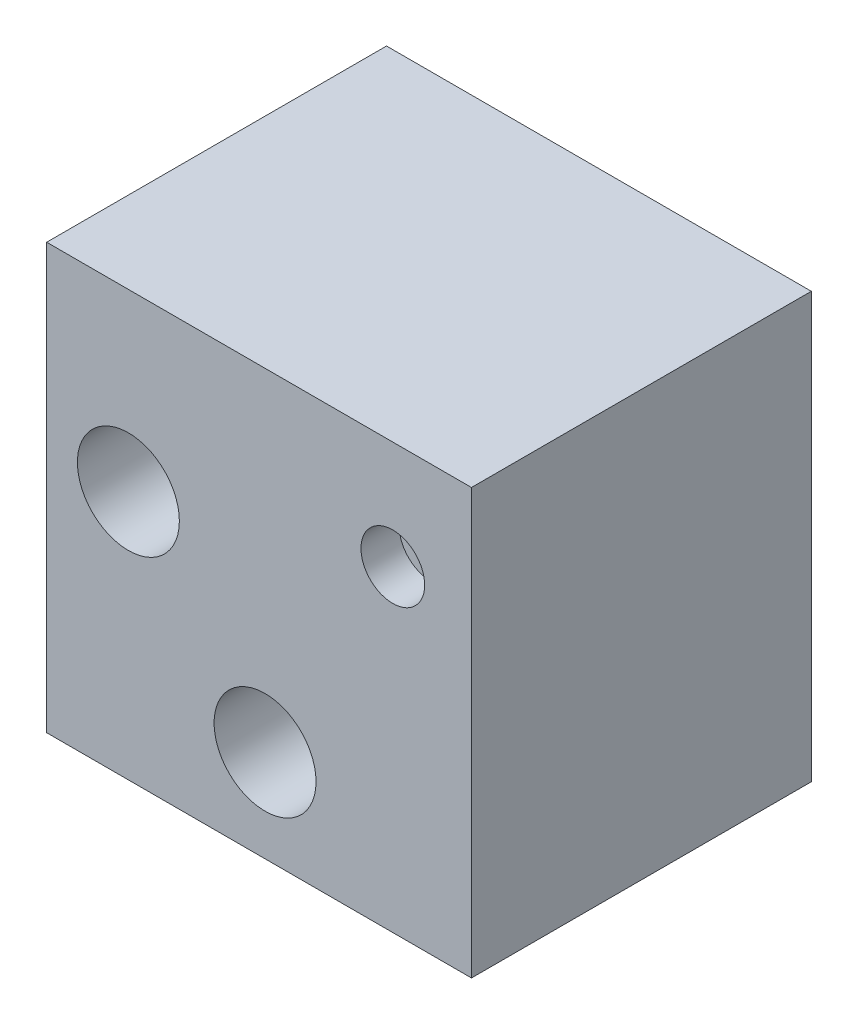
ISO-10303-21;
HEADER;
FILE_DESCRIPTION(('STEP AP214'),'2;1');
FILE_NAME('part.step','',(''),(''),'','','');
FILE_SCHEMA(('AUTOMOTIVE_DESIGN { 1 0 10303 214 1 1 1 1 }'));
ENDSEC;
DATA;
#1=APPLICATION_CONTEXT('core data for automotive mechanical design processes');
#2=APPLICATION_PROTOCOL_DEFINITION('international standard','automotive_design',2000,#1);
#3=PRODUCT_CONTEXT('',#1,'mechanical');
#4=PRODUCT('Part','Part','',(#3));
#5=PRODUCT_RELATED_PRODUCT_CATEGORY('part','',(#4));
#6=PRODUCT_DEFINITION_FORMATION('','',#4);
#7=PRODUCT_DEFINITION_CONTEXT('part definition',#1,'design');
#8=PRODUCT_DEFINITION('design','',#6,#7);
#9=PRODUCT_DEFINITION_SHAPE('','',#8);
#10=(LENGTH_UNIT() NAMED_UNIT(*) SI_UNIT(.MILLI.,.METRE.));
#11=(NAMED_UNIT(*) PLANE_ANGLE_UNIT() SI_UNIT($,.RADIAN.));
#12=(NAMED_UNIT(*) SI_UNIT($,.STERADIAN.) SOLID_ANGLE_UNIT());
#13=UNCERTAINTY_MEASURE_WITH_UNIT(LENGTH_MEASURE(1.E-05),#10,'distance_accuracy_value','');
#14=(GEOMETRIC_REPRESENTATION_CONTEXT(3) GLOBAL_UNCERTAINTY_ASSIGNED_CONTEXT((#13)) GLOBAL_UNIT_ASSIGNED_CONTEXT((#10,
#11,#12)) REPRESENTATION_CONTEXT('',''));
#15=CARTESIAN_POINT('',(0.,0.,0.));
#16=DIRECTION('',(0.,0.,1.));
#17=DIRECTION('',(1.,0.,0.));
#18=AXIS2_PLACEMENT_3D('',#15,#16,#17);
#19=CARTESIAN_POINT('',(0.,0.,80.));
#20=DIRECTION('',(1.,0.,0.));
#21=DIRECTION('',(0.,0.,-1.));
#22=AXIS2_PLACEMENT_3D('',#19,#20,#21);
#23=PLANE('',#22);
#24=DIRECTION('',(0.,-1.,0.));
#25=VECTOR('',#24,1.);
#26=CARTESIAN_POINT('',(0.,0.,0.));
#27=LINE('',#26,#25);
#28=CARTESIAN_POINT('',(0.,100.,0.));
#29=VERTEX_POINT('',#28);
#30=CARTESIAN_POINT('',(0.,0.,0.));
#31=VERTEX_POINT('',#30);
#32=EDGE_CURVE('E130',#29,#31,#27,.T.);
#33=ORIENTED_EDGE('',*,*,#32,.T.);
#34=DIRECTION('',(0.,0.,-1.));
#35=VECTOR('',#34,1.);
#36=CARTESIAN_POINT('',(0.,0.,80.));
#37=LINE('',#36,#35);
#38=CARTESIAN_POINT('',(0.,0.,80.));
#39=VERTEX_POINT('',#38);
#40=EDGE_CURVE('E11',#39,#31,#37,.T.);
#41=ORIENTED_EDGE('',*,*,#40,.F.);
#42=DIRECTION('',(0.,-1.,0.));
#43=VECTOR('',#42,1.);
#44=CARTESIAN_POINT('',(0.,0.,80.));
#45=LINE('',#44,#43);
#46=CARTESIAN_POINT('',(0.,100.,80.));
#47=VERTEX_POINT('',#46);
#48=EDGE_CURVE('E131',#47,#39,#45,.T.);
#49=ORIENTED_EDGE('',*,*,#48,.F.);
#50=DIRECTION('',(0.,0.,-1.));
#51=VECTOR('',#50,1.);
#52=CARTESIAN_POINT('',(0.,100.,80.));
#53=LINE('',#52,#51);
#54=EDGE_CURVE('E137',#47,#29,#53,.T.);
#55=ORIENTED_EDGE('',*,*,#54,.T.);
#56=EDGE_LOOP('',(#33,#41,#49,#55));
#57=FACE_BOUND('',#56,.T.);
#58=ADVANCED_FACE('F41',(#57),#23,.F.);
#59=CARTESIAN_POINT('',(0.,0.,80.));
#60=DIRECTION('',(0.,1.,0.));
#61=DIRECTION('',(0.,0.,1.));
#62=AXIS2_PLACEMENT_3D('',#59,#60,#61);
#63=PLANE('',#62);
#64=DIRECTION('',(1.,0.,0.));
#65=VECTOR('',#64,1.);
#66=CARTESIAN_POINT('',(0.,0.,0.));
#67=LINE('',#66,#65);
#68=CARTESIAN_POINT('',(100.,0.,0.));
#69=VERTEX_POINT('',#68);
#70=EDGE_CURVE('E140',#31,#69,#67,.T.);
#71=ORIENTED_EDGE('',*,*,#70,.T.);
#72=DIRECTION('',(0.,0.,-1.));
#73=VECTOR('',#72,1.);
#74=CARTESIAN_POINT('',(100.,0.,80.));
#75=LINE('',#74,#73);
#76=CARTESIAN_POINT('',(100.,0.,80.));
#77=VERTEX_POINT('',#76);
#78=EDGE_CURVE('E49',#77,#69,#75,.T.);
#79=ORIENTED_EDGE('',*,*,#78,.F.);
#80=DIRECTION('',(1.,0.,0.));
#81=VECTOR('',#80,1.);
#82=CARTESIAN_POINT('',(0.,0.,80.));
#83=LINE('',#82,#81);
#84=EDGE_CURVE('E88',#39,#77,#83,.T.);
#85=ORIENTED_EDGE('',*,*,#84,.F.);
#86=ORIENTED_EDGE('',*,*,#40,.T.);
#87=EDGE_LOOP('',(#71,#79,#85,#86));
#88=FACE_BOUND('',#87,.T.);
#89=ADVANCED_FACE('F164',(#88),#63,.F.);
#90=CARTESIAN_POINT('',(100.,0.,80.));
#91=DIRECTION('',(-1.,0.,0.));
#92=DIRECTION('',(0.,0.,1.));
#93=AXIS2_PLACEMENT_3D('',#90,#91,#92);
#94=PLANE('',#93);
#95=DIRECTION('',(0.,1.,0.));
#96=VECTOR('',#95,1.);
#97=CARTESIAN_POINT('',(100.,0.,0.));
#98=LINE('',#97,#96);
#99=CARTESIAN_POINT('',(100.,100.,0.));
#100=VERTEX_POINT('',#99);
#101=EDGE_CURVE('E75',#69,#100,#98,.T.);
#102=ORIENTED_EDGE('',*,*,#101,.T.);
#103=DIRECTION('',(0.,0.,-1.));
#104=VECTOR('',#103,1.);
#105=CARTESIAN_POINT('',(100.,100.,80.));
#106=LINE('',#105,#104);
#107=CARTESIAN_POINT('',(100.,100.,80.));
#108=VERTEX_POINT('',#107);
#109=EDGE_CURVE('E145',#108,#100,#106,.T.);
#110=ORIENTED_EDGE('',*,*,#109,.F.);
#111=DIRECTION('',(0.,1.,0.));
#112=VECTOR('',#111,1.);
#113=CARTESIAN_POINT('',(100.,0.,80.));
#114=LINE('',#113,#112);
#115=EDGE_CURVE('E134',#77,#108,#114,.T.);
#116=ORIENTED_EDGE('',*,*,#115,.F.);
#117=ORIENTED_EDGE('',*,*,#78,.T.);
#118=EDGE_LOOP('',(#102,#110,#116,#117));
#119=FACE_BOUND('',#118,.T.);
#120=ADVANCED_FACE('F147',(#119),#94,.F.);
#121=CARTESIAN_POINT('',(0.,100.,80.));
#122=DIRECTION('',(0.,-1.,0.));
#123=DIRECTION('',(0.,0.,-1.));
#124=AXIS2_PLACEMENT_3D('',#121,#122,#123);
#125=PLANE('',#124);
#126=DIRECTION('',(-1.,0.,0.));
#127=VECTOR('',#126,1.);
#128=CARTESIAN_POINT('',(0.,100.,0.));
#129=LINE('',#128,#127);
#130=EDGE_CURVE('E81',#100,#29,#129,.T.);
#131=ORIENTED_EDGE('',*,*,#130,.T.);
#132=ORIENTED_EDGE('',*,*,#54,.F.);
#133=DIRECTION('',(-1.,0.,0.));
#134=VECTOR('',#133,1.);
#135=CARTESIAN_POINT('',(0.,100.,80.));
#136=LINE('',#135,#134);
#137=EDGE_CURVE('E57',#108,#47,#136,.T.);
#138=ORIENTED_EDGE('',*,*,#137,.F.);
#139=ORIENTED_EDGE('',*,*,#109,.T.);
#140=EDGE_LOOP('',(#131,#132,#138,#139));
#141=FACE_BOUND('',#140,.T.);
#142=ADVANCED_FACE('F154',(#141),#125,.F.);
#143=CARTESIAN_POINT('',(0.,100.,80.));
#144=DIRECTION('',(0.,0.,-1.));
#145=DIRECTION('',(-1.,0.,0.));
#146=AXIS2_PLACEMENT_3D('',#143,#144,#145);
#147=PLANE('',#146);
#148=CARTESIAN_POINT('',(81.479946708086,74.5868835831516,80.));
#149=DIRECTION('',(0.,0.,1.));
#150=DIRECTION('',(1.,0.,0.));
#151=AXIS2_PLACEMENT_3D('',#148,#149,#150);
#152=CIRCLE('',#151,7.50000000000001);
#153=CARTESIAN_POINT('',(88.979946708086,74.5868835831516,80.));
#154=VERTEX_POINT('',#153);
#155=EDGE_CURVE('E352',#154,#154,#152,.T.);
#156=ORIENTED_EDGE('',*,*,#155,.F.);
#157=EDGE_LOOP('',(#156));
#158=FACE_BOUND('',#157,.T.);
#159=CARTESIAN_POINT('',(19.2360886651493,58.7670579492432,80.));
#160=DIRECTION('',(0.,0.,1.));
#161=DIRECTION('',(1.,0.,0.));
#162=AXIS2_PLACEMENT_3D('',#159,#160,#161);
#163=CIRCLE('',#162,12.);
#164=CARTESIAN_POINT('',(31.2360886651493,58.7670579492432,80.));
#165=VERTEX_POINT('',#164);
#166=EDGE_CURVE('E362',#165,#165,#163,.T.);
#167=ORIENTED_EDGE('',*,*,#166,.F.);
#168=EDGE_LOOP('',(#167));
#169=FACE_BOUND('',#168,.T.);
#170=CARTESIAN_POINT('',(51.4111414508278,21.704928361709,80.));
#171=DIRECTION('',(0.,0.,1.));
#172=DIRECTION('',(1.,0.,0.));
#173=AXIS2_PLACEMENT_3D('',#170,#171,#172);
#174=CIRCLE('',#173,12.);
#175=CARTESIAN_POINT('',(63.4111414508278,21.704928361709,80.));
#176=VERTEX_POINT('',#175);
#177=EDGE_CURVE('E105',#176,#176,#174,.T.);
#178=ORIENTED_EDGE('',*,*,#177,.F.);
#179=EDGE_LOOP('',(#178));
#180=FACE_BOUND('',#179,.T.);
#181=ORIENTED_EDGE('',*,*,#48,.T.);
#182=ORIENTED_EDGE('',*,*,#84,.T.);
#183=ORIENTED_EDGE('',*,*,#115,.T.);
#184=ORIENTED_EDGE('',*,*,#137,.T.);
#185=EDGE_LOOP('',(#181,#182,#183,#184));
#186=FACE_BOUND('',#185,.T.);
#187=ADVANCED_FACE('F156',(#158,#169,#180,#186),#147,.F.);
#188=CARTESIAN_POINT('',(0.,100.,0.));
#189=DIRECTION('',(0.,0.,-1.));
#190=DIRECTION('',(-1.,0.,0.));
#191=AXIS2_PLACEMENT_3D('',#188,#189,#190);
#192=PLANE('',#191);
#193=CARTESIAN_POINT('',(81.479946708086,74.5868835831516,0.));
#194=DIRECTION('',(0.,0.,1.));
#195=DIRECTION('',(1.,0.,0.));
#196=AXIS2_PLACEMENT_3D('',#193,#194,#195);
#197=CIRCLE('',#196,4.20000000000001);
#198=CARTESIAN_POINT('',(85.679946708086,74.5868835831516,0.));
#199=VERTEX_POINT('',#198);
#200=EDGE_CURVE('E359',#199,#199,#197,.T.);
#201=ORIENTED_EDGE('',*,*,#200,.T.);
#202=EDGE_LOOP('',(#201));
#203=FACE_BOUND('',#202,.T.);
#204=ORIENTED_EDGE('',*,*,#32,.F.);
#205=ORIENTED_EDGE('',*,*,#130,.F.);
#206=ORIENTED_EDGE('',*,*,#101,.F.);
#207=ORIENTED_EDGE('',*,*,#70,.F.);
#208=EDGE_LOOP('',(#204,#205,#206,#207));
#209=FACE_BOUND('',#208,.T.);
#210=ADVANCED_FACE('F150',(#203,#209),#192,.T.);
#211=CARTESIAN_POINT('',(51.4111414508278,21.704928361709,20.));
#212=DIRECTION('',(0.,0.,1.));
#213=DIRECTION('',(1.,0.,0.));
#214=AXIS2_PLACEMENT_3D('',#211,#212,#213);
#215=CONICAL_SURFACE('',#214,5.,1.02974425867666);
#216=CARTESIAN_POINT('',(51.4111414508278,21.704928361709,16.9956969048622));
#217=VERTEX_POINT('',#216);
#218=VERTEX_LOOP('',#217);
#219=FACE_BOUND('',#218,.T.);
#220=CARTESIAN_POINT('',(51.4111414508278,21.704928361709,20.));
#221=DIRECTION('',(0.,0.,1.));
#222=DIRECTION('',(1.,0.,0.));
#223=AXIS2_PLACEMENT_3D('',#220,#221,#222);
#224=CIRCLE('',#223,5.);
#225=CARTESIAN_POINT('',(56.4111414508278,21.704928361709,20.));
#226=VERTEX_POINT('',#225);
#227=EDGE_CURVE('E127',#226,#226,#224,.T.);
#228=ORIENTED_EDGE('',*,*,#227,.T.);
#229=EDGE_LOOP('',(#228));
#230=FACE_BOUND('',#229,.T.);
#231=ADVANCED_FACE('F187',(#219,#230),#215,.F.);
#232=CARTESIAN_POINT('',(51.4111414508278,21.704928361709,80.));
#233=DIRECTION('',(0.,0.,1.));
#234=DIRECTION('',(1.,0.,0.));
#235=AXIS2_PLACEMENT_3D('',#232,#233,#234);
#236=CYLINDRICAL_SURFACE('',#235,5.);
#237=ORIENTED_EDGE('',*,*,#227,.F.);
#238=EDGE_LOOP('',(#237));
#239=FACE_BOUND('',#238,.T.);
#240=CARTESIAN_POINT('',(51.4111414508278,21.704928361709,45.));
#241=DIRECTION('',(0.,0.,1.));
#242=DIRECTION('',(1.,0.,0.));
#243=AXIS2_PLACEMENT_3D('',#240,#241,#242);
#244=CIRCLE('',#243,5.);
#245=CARTESIAN_POINT('',(56.4111414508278,21.704928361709,45.));
#246=VERTEX_POINT('',#245);
#247=EDGE_CURVE('E124',#246,#246,#244,.T.);
#248=ORIENTED_EDGE('',*,*,#247,.T.);
#249=EDGE_LOOP('',(#248));
#250=FACE_BOUND('',#249,.T.);
#251=ADVANCED_FACE('F192',(#239,#250),#236,.F.);
#252=CARTESIAN_POINT('',(57.6111414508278,21.704928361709,45.));
#253=DIRECTION('',(0.,0.,-1.));
#254=DIRECTION('',(-1.,0.,0.));
#255=AXIS2_PLACEMENT_3D('',#252,#253,#254);
#256=PLANE('',#255);
#257=ORIENTED_EDGE('',*,*,#247,.F.);
#258=EDGE_LOOP('',(#257));
#259=FACE_BOUND('',#258,.T.);
#260=CARTESIAN_POINT('',(51.4111414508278,21.704928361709,45.));
#261=DIRECTION('',(0.,0.,1.));
#262=DIRECTION('',(1.,0.,0.));
#263=AXIS2_PLACEMENT_3D('',#260,#261,#262);
#264=CIRCLE('',#263,6.2);
#265=CARTESIAN_POINT('',(57.6111414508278,21.704928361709,45.));
#266=VERTEX_POINT('',#265);
#267=EDGE_CURVE('E121',#266,#266,#264,.T.);
#268=ORIENTED_EDGE('',*,*,#267,.T.);
#269=EDGE_LOOP('',(#268));
#270=FACE_BOUND('',#269,.T.);
#271=ADVANCED_FACE('F204',(#259,#270),#256,.F.);
#272=CARTESIAN_POINT('',(51.4111414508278,21.704928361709,80.));
#273=DIRECTION('',(0.,0.,1.));
#274=DIRECTION('',(1.,0.,0.));
#275=AXIS2_PLACEMENT_3D('',#272,#273,#274);
#276=CYLINDRICAL_SURFACE('',#275,6.2);
#277=ORIENTED_EDGE('',*,*,#267,.F.);
#278=EDGE_LOOP('',(#277));
#279=FACE_BOUND('',#278,.T.);
#280=CARTESIAN_POINT('',(51.4111414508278,21.704928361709,60.));
#281=DIRECTION('',(0.,0.,1.));
#282=DIRECTION('',(1.,0.,0.));
#283=AXIS2_PLACEMENT_3D('',#280,#281,#282);
#284=CIRCLE('',#283,6.2);
#285=CARTESIAN_POINT('',(57.6111414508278,21.704928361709,60.));
#286=VERTEX_POINT('',#285);
#287=EDGE_CURVE('E118',#286,#286,#284,.T.);
#288=ORIENTED_EDGE('',*,*,#287,.T.);
#289=EDGE_LOOP('',(#288));
#290=FACE_BOUND('',#289,.T.);
#291=ADVANCED_FACE('F214',(#279,#290),#276,.F.);
#292=CARTESIAN_POINT('',(57.6111414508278,21.704928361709,60.));
#293=DIRECTION('',(0.,0.,-1.));
#294=DIRECTION('',(-1.,0.,0.));
#295=AXIS2_PLACEMENT_3D('',#292,#293,#294);
#296=PLANE('',#295);
#297=ORIENTED_EDGE('',*,*,#287,.F.);
#298=EDGE_LOOP('',(#297));
#299=FACE_BOUND('',#298,.T.);
#300=CARTESIAN_POINT('',(51.4111414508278,21.704928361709,60.));
#301=DIRECTION('',(0.,0.,1.));
#302=DIRECTION('',(1.,0.,0.));
#303=AXIS2_PLACEMENT_3D('',#300,#301,#302);
#304=CIRCLE('',#303,12.);
#305=CARTESIAN_POINT('',(63.4111414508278,21.704928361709,60.));
#306=VERTEX_POINT('',#305);
#307=EDGE_CURVE('E109',#306,#306,#304,.T.);
#308=ORIENTED_EDGE('',*,*,#307,.T.);
#309=EDGE_LOOP('',(#308));
#310=FACE_BOUND('',#309,.T.);
#311=ADVANCED_FACE('F225',(#299,#310),#296,.F.);
#312=CARTESIAN_POINT('',(51.4111414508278,21.704928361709,80.));
#313=DIRECTION('',(0.,0.,1.));
#314=DIRECTION('',(1.,0.,0.));
#315=AXIS2_PLACEMENT_3D('',#312,#313,#314);
#316=CYLINDRICAL_SURFACE('',#315,12.);
#317=ORIENTED_EDGE('',*,*,#307,.F.);
#318=EDGE_LOOP('',(#317));
#319=FACE_BOUND('',#318,.T.);
#320=ORIENTED_EDGE('',*,*,#177,.T.);
#321=EDGE_LOOP('',(#320));
#322=FACE_BOUND('',#321,.T.);
#323=ADVANCED_FACE('F99',(#319,#322),#316,.F.);
#324=CARTESIAN_POINT('',(19.2360886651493,58.7670579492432,20.));
#325=DIRECTION('',(0.,0.,1.));
#326=DIRECTION('',(1.,0.,0.));
#327=AXIS2_PLACEMENT_3D('',#324,#325,#326);
#328=CONICAL_SURFACE('',#327,5.,1.02974425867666);
#329=CARTESIAN_POINT('',(19.2360886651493,58.7670579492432,16.9956969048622));
#330=VERTEX_POINT('',#329);
#331=VERTEX_LOOP('',#330);
#332=FACE_BOUND('',#331,.T.);
#333=CARTESIAN_POINT('',(19.2360886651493,58.7670579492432,20.));
#334=DIRECTION('',(0.,0.,1.));
#335=DIRECTION('',(1.,0.,0.));
#336=AXIS2_PLACEMENT_3D('',#333,#334,#335);
#337=CIRCLE('',#336,5.);
#338=CARTESIAN_POINT('',(24.2360886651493,58.7670579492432,20.));
#339=VERTEX_POINT('',#338);
#340=EDGE_CURVE('E103',#339,#339,#337,.T.);
#341=ORIENTED_EDGE('',*,*,#340,.T.);
#342=EDGE_LOOP('',(#341));
#343=FACE_BOUND('',#342,.T.);
#344=ADVANCED_FACE('F95',(#332,#343),#328,.F.);
#345=CARTESIAN_POINT('',(19.2360886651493,58.7670579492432,80.));
#346=DIRECTION('',(0.,0.,1.));
#347=DIRECTION('',(1.,0.,0.));
#348=AXIS2_PLACEMENT_3D('',#345,#346,#347);
#349=CYLINDRICAL_SURFACE('',#348,5.);
#350=ORIENTED_EDGE('',*,*,#340,.F.);
#351=EDGE_LOOP('',(#350));
#352=FACE_BOUND('',#351,.T.);
#353=CARTESIAN_POINT('',(19.2360886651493,58.7670579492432,45.));
#354=DIRECTION('',(0.,0.,1.));
#355=DIRECTION('',(1.,0.,0.));
#356=AXIS2_PLACEMENT_3D('',#353,#354,#355);
#357=CIRCLE('',#356,5.);
#358=CARTESIAN_POINT('',(24.2360886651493,58.7670579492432,45.));
#359=VERTEX_POINT('',#358);
#360=EDGE_CURVE('E106',#359,#359,#357,.T.);
#361=ORIENTED_EDGE('',*,*,#360,.T.);
#362=EDGE_LOOP('',(#361));
#363=FACE_BOUND('',#362,.T.);
#364=ADVANCED_FACE('F98',(#352,#363),#349,.F.);
#365=CARTESIAN_POINT('',(25.4360886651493,58.7670579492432,45.));
#366=DIRECTION('',(0.,0.,-1.));
#367=DIRECTION('',(-1.,0.,0.));
#368=AXIS2_PLACEMENT_3D('',#365,#366,#367);
#369=PLANE('',#368);
#370=ORIENTED_EDGE('',*,*,#360,.F.);
#371=EDGE_LOOP('',(#370));
#372=FACE_BOUND('',#371,.T.);
#373=CARTESIAN_POINT('',(19.2360886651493,58.7670579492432,45.));
#374=DIRECTION('',(0.,0.,1.));
#375=DIRECTION('',(1.,0.,0.));
#376=AXIS2_PLACEMENT_3D('',#373,#374,#375);
#377=CIRCLE('',#376,6.2);
#378=CARTESIAN_POINT('',(25.4360886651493,58.7670579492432,45.));
#379=VERTEX_POINT('',#378);
#380=EDGE_CURVE('E112',#379,#379,#377,.T.);
#381=ORIENTED_EDGE('',*,*,#380,.T.);
#382=EDGE_LOOP('',(#381));
#383=FACE_BOUND('',#382,.T.);
#384=ADVANCED_FACE('F260',(#372,#383),#369,.F.);
#385=CARTESIAN_POINT('',(19.2360886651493,58.7670579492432,80.));
#386=DIRECTION('',(0.,0.,1.));
#387=DIRECTION('',(1.,0.,0.));
#388=AXIS2_PLACEMENT_3D('',#385,#386,#387);
#389=CYLINDRICAL_SURFACE('',#388,6.2);
#390=ORIENTED_EDGE('',*,*,#380,.F.);
#391=EDGE_LOOP('',(#390));
#392=FACE_BOUND('',#391,.T.);
#393=CARTESIAN_POINT('',(19.2360886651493,58.7670579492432,60.));
#394=DIRECTION('',(0.,0.,1.));
#395=DIRECTION('',(1.,0.,0.));
#396=AXIS2_PLACEMENT_3D('',#393,#394,#395);
#397=CIRCLE('',#396,6.2);
#398=CARTESIAN_POINT('',(25.4360886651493,58.7670579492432,60.));
#399=VERTEX_POINT('',#398);
#400=EDGE_CURVE('E368',#399,#399,#397,.T.);
#401=ORIENTED_EDGE('',*,*,#400,.T.);
#402=EDGE_LOOP('',(#401));
#403=FACE_BOUND('',#402,.T.);
#404=ADVANCED_FACE('F269',(#392,#403),#389,.F.);
#405=CARTESIAN_POINT('',(25.4360886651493,58.7670579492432,60.));
#406=DIRECTION('',(0.,0.,-1.));
#407=DIRECTION('',(-1.,0.,0.));
#408=AXIS2_PLACEMENT_3D('',#405,#406,#407);
#409=PLANE('',#408);
#410=ORIENTED_EDGE('',*,*,#400,.F.);
#411=EDGE_LOOP('',(#410));
#412=FACE_BOUND('',#411,.T.);
#413=CARTESIAN_POINT('',(19.2360886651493,58.7670579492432,60.));
#414=DIRECTION('',(0.,0.,1.));
#415=DIRECTION('',(1.,0.,0.));
#416=AXIS2_PLACEMENT_3D('',#413,#414,#415);
#417=CIRCLE('',#416,12.);
#418=CARTESIAN_POINT('',(31.2360886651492,58.7670579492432,60.));
#419=VERTEX_POINT('',#418);
#420=EDGE_CURVE('E365',#419,#419,#417,.T.);
#421=ORIENTED_EDGE('',*,*,#420,.T.);
#422=EDGE_LOOP('',(#421));
#423=FACE_BOUND('',#422,.T.);
#424=ADVANCED_FACE('F279',(#412,#423),#409,.F.);
#425=CARTESIAN_POINT('',(19.2360886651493,58.7670579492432,80.));
#426=DIRECTION('',(0.,0.,1.));
#427=DIRECTION('',(1.,0.,0.));
#428=AXIS2_PLACEMENT_3D('',#425,#426,#427);
#429=CYLINDRICAL_SURFACE('',#428,12.);
#430=ORIENTED_EDGE('',*,*,#420,.F.);
#431=EDGE_LOOP('',(#430));
#432=FACE_BOUND('',#431,.T.);
#433=ORIENTED_EDGE('',*,*,#166,.T.);
#434=EDGE_LOOP('',(#433));
#435=FACE_BOUND('',#434,.T.);
#436=ADVANCED_FACE('F290',(#432,#435),#429,.F.);
#437=CARTESIAN_POINT('',(81.479946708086,74.5868835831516,80.));
#438=DIRECTION('',(0.,0.,1.));
#439=DIRECTION('',(1.,0.,0.));
#440=AXIS2_PLACEMENT_3D('',#437,#438,#439);
#441=CYLINDRICAL_SURFACE('',#440,4.20000000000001);
#442=ORIENTED_EDGE('',*,*,#200,.F.);
#443=EDGE_LOOP('',(#442));
#444=FACE_BOUND('',#443,.T.);
#445=CARTESIAN_POINT('',(81.479946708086,74.5868835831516,71.));
#446=DIRECTION('',(0.,0.,1.));
#447=DIRECTION('',(1.,0.,0.));
#448=AXIS2_PLACEMENT_3D('',#445,#446,#447);
#449=CIRCLE('',#448,4.20000000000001);
#450=CARTESIAN_POINT('',(85.679946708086,74.5868835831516,71.));
#451=VERTEX_POINT('',#450);
#452=EDGE_CURVE('E354',#451,#451,#449,.T.);
#453=ORIENTED_EDGE('',*,*,#452,.T.);
#454=EDGE_LOOP('',(#453));
#455=FACE_BOUND('',#454,.T.);
#456=ADVANCED_FACE('F300',(#444,#455),#441,.F.);
#457=CARTESIAN_POINT('',(85.679946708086,74.5868835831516,71.));
#458=DIRECTION('',(0.,0.,-1.));
#459=DIRECTION('',(-1.,0.,0.));
#460=AXIS2_PLACEMENT_3D('',#457,#458,#459);
#461=PLANE('',#460);
#462=ORIENTED_EDGE('',*,*,#452,.F.);
#463=EDGE_LOOP('',(#462));
#464=FACE_BOUND('',#463,.T.);
#465=CARTESIAN_POINT('',(81.479946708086,74.5868835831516,71.));
#466=DIRECTION('',(0.,0.,1.));
#467=DIRECTION('',(1.,0.,0.));
#468=AXIS2_PLACEMENT_3D('',#465,#466,#467);
#469=CIRCLE('',#468,7.50000000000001);
#470=CARTESIAN_POINT('',(88.979946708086,74.5868835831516,71.));
#471=VERTEX_POINT('',#470);
#472=EDGE_CURVE('E349',#471,#471,#469,.T.);
#473=ORIENTED_EDGE('',*,*,#472,.T.);
#474=EDGE_LOOP('',(#473));
#475=FACE_BOUND('',#474,.T.);
#476=ADVANCED_FACE('F321',(#464,#475),#461,.F.);
#477=CARTESIAN_POINT('',(81.479946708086,74.5868835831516,80.));
#478=DIRECTION('',(0.,0.,1.));
#479=DIRECTION('',(1.,0.,0.));
#480=AXIS2_PLACEMENT_3D('',#477,#478,#479);
#481=CYLINDRICAL_SURFACE('',#480,7.50000000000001);
#482=ORIENTED_EDGE('',*,*,#472,.F.);
#483=EDGE_LOOP('',(#482));
#484=FACE_BOUND('',#483,.T.);
#485=ORIENTED_EDGE('',*,*,#155,.T.);
#486=EDGE_LOOP('',(#485));
#487=FACE_BOUND('',#486,.T.);
#488=ADVANCED_FACE('F332',(#484,#487),#481,.F.);
#489=CLOSED_SHELL('',(#58,#89,#120,#142,#187,#210,#231,#251,#271,#291,#311,#323,#344,#364,#384,
#404,#424,#436,#456,#476,#488));
#490=MANIFOLD_SOLID_BREP('B2',#489);
#491=ADVANCED_BREP_SHAPE_REPRESENTATION('',(#18,#490),#14);
#492=SHAPE_DEFINITION_REPRESENTATION(#9,#491);
ENDSEC;
END-ISO-10303-21;
